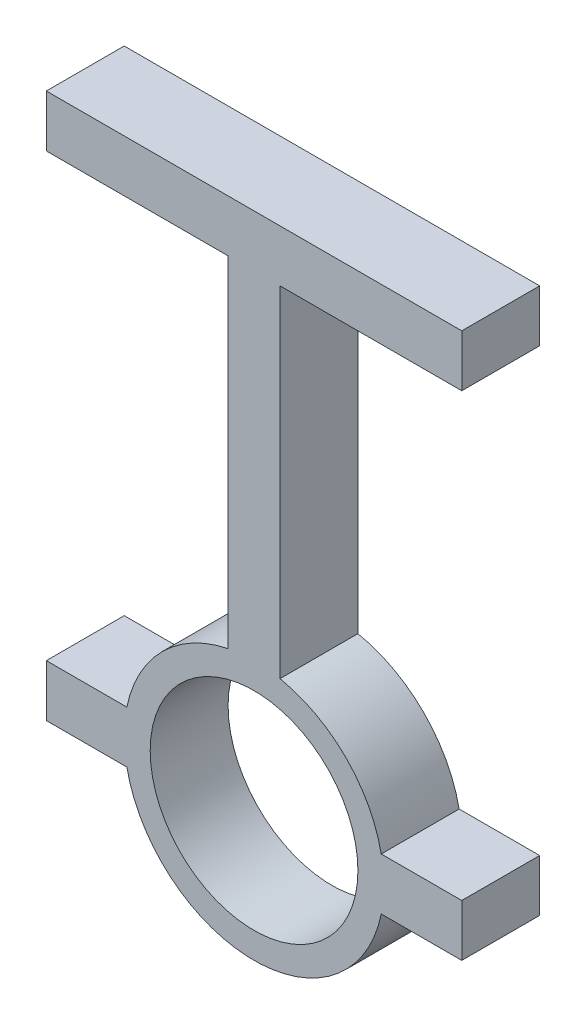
ISO-10303-21;
HEADER;
FILE_DESCRIPTION(('STEP AP214'),'2;1');
FILE_NAME('part.step','',(''),(''),'','','');
FILE_SCHEMA(('AUTOMOTIVE_DESIGN { 1 0 10303 214 1 1 1 1 }'));
ENDSEC;
DATA;
#1=APPLICATION_CONTEXT('core data for automotive mechanical design processes');
#2=APPLICATION_PROTOCOL_DEFINITION('international standard','automotive_design',2000,#1);
#3=PRODUCT_CONTEXT('',#1,'mechanical');
#4=PRODUCT('Part','Part','',(#3));
#5=PRODUCT_RELATED_PRODUCT_CATEGORY('part','',(#4));
#6=PRODUCT_DEFINITION_FORMATION('','',#4);
#7=PRODUCT_DEFINITION_CONTEXT('part definition',#1,'design');
#8=PRODUCT_DEFINITION('design','',#6,#7);
#9=PRODUCT_DEFINITION_SHAPE('','',#8);
#10=(LENGTH_UNIT() NAMED_UNIT(*) SI_UNIT(.MILLI.,.METRE.));
#11=(NAMED_UNIT(*) PLANE_ANGLE_UNIT() SI_UNIT($,.RADIAN.));
#12=(NAMED_UNIT(*) SI_UNIT($,.STERADIAN.) SOLID_ANGLE_UNIT());
#13=UNCERTAINTY_MEASURE_WITH_UNIT(LENGTH_MEASURE(1.E-05),#10,'distance_accuracy_value','');
#14=(GEOMETRIC_REPRESENTATION_CONTEXT(3) GLOBAL_UNCERTAINTY_ASSIGNED_CONTEXT((#13)) GLOBAL_UNIT_ASSIGNED_CONTEXT((#10,
#11,#12)) REPRESENTATION_CONTEXT('',''));
#15=CARTESIAN_POINT('',(0.,0.,0.));
#16=DIRECTION('',(0.,0.,1.));
#17=DIRECTION('',(1.,0.,0.));
#18=AXIS2_PLACEMENT_3D('',#15,#16,#17);
#19=CARTESIAN_POINT('',(0.,0.,15.));
#20=DIRECTION('',(0.,0.,1.));
#21=DIRECTION('',(1.,0.,0.));
#22=AXIS2_PLACEMENT_3D('',#19,#20,#21);
#23=PLANE('',#22);
#24=DIRECTION('',(1.,0.,0.));
#25=VECTOR('',#24,1.);
#26=CARTESIAN_POINT('',(40.,90.,15.));
#27=LINE('',#26,#25);
#28=CARTESIAN_POINT('',(5.,90.,15.));
#29=VERTEX_POINT('',#28);
#30=CARTESIAN_POINT('',(40.,90.,15.));
#31=VERTEX_POINT('',#30);
#32=EDGE_CURVE('E209',#29,#31,#27,.T.);
#33=ORIENTED_EDGE('',*,*,#32,.T.);
#34=DIRECTION('',(0.,1.,0.));
#35=VECTOR('',#34,1.);
#36=CARTESIAN_POINT('',(40.,100.,15.));
#37=LINE('',#36,#35);
#38=CARTESIAN_POINT('',(40.,100.,15.));
#39=VERTEX_POINT('',#38);
#40=EDGE_CURVE('E117',#31,#39,#37,.T.);
#41=ORIENTED_EDGE('',*,*,#40,.T.);
#42=DIRECTION('',(-1.,0.,0.));
#43=VECTOR('',#42,1.);
#44=CARTESIAN_POINT('',(-40.,100.,15.));
#45=LINE('',#44,#43);
#46=CARTESIAN_POINT('',(-40.,100.,15.));
#47=VERTEX_POINT('',#46);
#48=EDGE_CURVE('E248',#39,#47,#45,.T.);
#49=ORIENTED_EDGE('',*,*,#48,.T.);
#50=DIRECTION('',(0.,-1.,0.));
#51=VECTOR('',#50,1.);
#52=CARTESIAN_POINT('',(-40.,90.,15.));
#53=LINE('',#52,#51);
#54=CARTESIAN_POINT('',(-40.,90.,15.));
#55=VERTEX_POINT('',#54);
#56=EDGE_CURVE('E267',#47,#55,#53,.T.);
#57=ORIENTED_EDGE('',*,*,#56,.T.);
#58=DIRECTION('',(1.,0.,0.));
#59=VECTOR('',#58,1.);
#60=CARTESIAN_POINT('',(-5.,90.,15.));
#61=LINE('',#60,#59);
#62=CARTESIAN_POINT('',(-5.,90.,15.));
#63=VERTEX_POINT('',#62);
#64=EDGE_CURVE('E264',#55,#63,#61,.T.);
#65=ORIENTED_EDGE('',*,*,#64,.T.);
#66=DIRECTION('',(0.,-1.,0.));
#67=VECTOR('',#66,1.);
#68=CARTESIAN_POINT('',(-5.,24.4948974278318,15.));
#69=LINE('',#68,#67);
#70=CARTESIAN_POINT('',(-5.,24.4948974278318,15.));
#71=VERTEX_POINT('',#70);
#72=EDGE_CURVE('E266',#63,#71,#69,.T.);
#73=ORIENTED_EDGE('',*,*,#72,.T.);
#74=CARTESIAN_POINT('',(0.,0.,15.));
#75=DIRECTION('',(0.,0.,1.));
#76=DIRECTION('',(1.,0.,0.));
#77=AXIS2_PLACEMENT_3D('',#74,#75,#76);
#78=CIRCLE('',#77,25.);
#79=CARTESIAN_POINT('',(-24.4948974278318,5.,15.));
#80=VERTEX_POINT('',#79);
#81=EDGE_CURVE('E269',#71,#80,#78,.T.);
#82=ORIENTED_EDGE('',*,*,#81,.T.);
#83=DIRECTION('',(-1.,0.,0.));
#84=VECTOR('',#83,1.);
#85=CARTESIAN_POINT('',(-24.4948974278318,5.,15.));
#86=LINE('',#85,#84);
#87=CARTESIAN_POINT('',(-40.,5.,15.));
#88=VERTEX_POINT('',#87);
#89=EDGE_CURVE('E275',#80,#88,#86,.T.);
#90=ORIENTED_EDGE('',*,*,#89,.T.);
#91=DIRECTION('',(0.,-1.,0.));
#92=VECTOR('',#91,1.);
#93=CARTESIAN_POINT('',(-40.,-5.,15.));
#94=LINE('',#93,#92);
#95=CARTESIAN_POINT('',(-40.,-5.,15.));
#96=VERTEX_POINT('',#95);
#97=EDGE_CURVE('E277',#88,#96,#94,.T.);
#98=ORIENTED_EDGE('',*,*,#97,.T.);
#99=DIRECTION('',(1.,0.,0.));
#100=VECTOR('',#99,1.);
#101=CARTESIAN_POINT('',(-24.4948974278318,-5.,15.));
#102=LINE('',#101,#100);
#103=CARTESIAN_POINT('',(-24.4948974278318,-4.99999999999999,15.));
#104=VERTEX_POINT('',#103);
#105=EDGE_CURVE('E279',#96,#104,#102,.T.);
#106=ORIENTED_EDGE('',*,*,#105,.T.);
#107=CARTESIAN_POINT('',(0.,0.,15.));
#108=DIRECTION('',(0.,0.,1.));
#109=DIRECTION('',(1.,0.,0.));
#110=AXIS2_PLACEMENT_3D('',#107,#108,#109);
#111=CIRCLE('',#110,25.);
#112=CARTESIAN_POINT('',(24.4948974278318,-5.,15.));
#113=VERTEX_POINT('',#112);
#114=EDGE_CURVE('E281',#104,#113,#111,.T.);
#115=ORIENTED_EDGE('',*,*,#114,.T.);
#116=DIRECTION('',(1.,0.,0.));
#117=VECTOR('',#116,1.);
#118=CARTESIAN_POINT('',(40.,-5.,15.));
#119=LINE('',#118,#117);
#120=CARTESIAN_POINT('',(40.,-5.,15.));
#121=VERTEX_POINT('',#120);
#122=EDGE_CURVE('E283',#113,#121,#119,.T.);
#123=ORIENTED_EDGE('',*,*,#122,.T.);
#124=DIRECTION('',(0.,1.,0.));
#125=VECTOR('',#124,1.);
#126=CARTESIAN_POINT('',(40.,-5.,15.));
#127=LINE('',#126,#125);
#128=CARTESIAN_POINT('',(40.,5.,15.));
#129=VERTEX_POINT('',#128);
#130=EDGE_CURVE('E160',#121,#129,#127,.T.);
#131=ORIENTED_EDGE('',*,*,#130,.T.);
#132=DIRECTION('',(-1.,0.,0.));
#133=VECTOR('',#132,1.);
#134=CARTESIAN_POINT('',(40.,5.,15.));
#135=LINE('',#134,#133);
#136=CARTESIAN_POINT('',(24.4948974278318,5.,15.));
#137=VERTEX_POINT('',#136);
#138=EDGE_CURVE('E154',#129,#137,#135,.T.);
#139=ORIENTED_EDGE('',*,*,#138,.T.);
#140=CARTESIAN_POINT('',(0.,0.,15.));
#141=DIRECTION('',(0.,0.,1.));
#142=DIRECTION('',(1.,0.,0.));
#143=AXIS2_PLACEMENT_3D('',#140,#141,#142);
#144=CIRCLE('',#143,25.);
#145=CARTESIAN_POINT('',(5.,24.4948974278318,15.));
#146=VERTEX_POINT('',#145);
#147=EDGE_CURVE('E158',#137,#146,#144,.T.);
#148=ORIENTED_EDGE('',*,*,#147,.T.);
#149=DIRECTION('',(0.,1.,0.));
#150=VECTOR('',#149,1.);
#151=CARTESIAN_POINT('',(5.,24.4948974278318,15.));
#152=LINE('',#151,#150);
#153=EDGE_CURVE('E50',#146,#29,#152,.T.);
#154=ORIENTED_EDGE('',*,*,#153,.T.);
#155=EDGE_LOOP('',(#33,#41,#49,#57,#65,#73,#82,#90,#98,#106,#115,#123,#131,#139,#148,#154));
#156=FACE_BOUND('',#155,.T.);
#157=CARTESIAN_POINT('',(0.,0.,15.));
#158=DIRECTION('',(0.,0.,1.));
#159=DIRECTION('',(1.,0.,0.));
#160=AXIS2_PLACEMENT_3D('',#157,#158,#159);
#161=CIRCLE('',#160,20.);
#162=CARTESIAN_POINT('',(20.,0.,15.));
#163=VERTEX_POINT('',#162);
#164=EDGE_CURVE('E182',#163,#163,#161,.T.);
#165=ORIENTED_EDGE('',*,*,#164,.F.);
#166=EDGE_LOOP('',(#165));
#167=FACE_BOUND('',#166,.T.);
#168=ADVANCED_FACE('F33',(#156,#167),#23,.T.);
#169=CARTESIAN_POINT('',(0.,0.,0.));
#170=DIRECTION('',(0.,0.,1.));
#171=DIRECTION('',(1.,0.,0.));
#172=AXIS2_PLACEMENT_3D('',#169,#170,#171);
#173=PLANE('',#172);
#174=DIRECTION('',(1.,0.,0.));
#175=VECTOR('',#174,1.);
#176=CARTESIAN_POINT('',(40.,90.,0.));
#177=LINE('',#176,#175);
#178=CARTESIAN_POINT('',(5.,90.,0.));
#179=VERTEX_POINT('',#178);
#180=CARTESIAN_POINT('',(40.,90.,0.));
#181=VERTEX_POINT('',#180);
#182=EDGE_CURVE('E178',#179,#181,#177,.T.);
#183=ORIENTED_EDGE('',*,*,#182,.F.);
#184=DIRECTION('',(0.,1.,0.));
#185=VECTOR('',#184,1.);
#186=CARTESIAN_POINT('',(5.,24.4948974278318,0.));
#187=LINE('',#186,#185);
#188=CARTESIAN_POINT('',(5.,24.4948974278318,0.));
#189=VERTEX_POINT('',#188);
#190=EDGE_CURVE('E109',#189,#179,#187,.T.);
#191=ORIENTED_EDGE('',*,*,#190,.F.);
#192=CARTESIAN_POINT('',(0.,0.,0.));
#193=DIRECTION('',(0.,0.,1.));
#194=DIRECTION('',(1.,0.,0.));
#195=AXIS2_PLACEMENT_3D('',#192,#193,#194);
#196=CIRCLE('',#195,25.);
#197=CARTESIAN_POINT('',(24.4948974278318,5.,0.));
#198=VERTEX_POINT('',#197);
#199=EDGE_CURVE('E103',#198,#189,#196,.T.);
#200=ORIENTED_EDGE('',*,*,#199,.F.);
#201=DIRECTION('',(-1.,0.,0.));
#202=VECTOR('',#201,1.);
#203=CARTESIAN_POINT('',(40.,5.,0.));
#204=LINE('',#203,#202);
#205=CARTESIAN_POINT('',(40.,5.,0.));
#206=VERTEX_POINT('',#205);
#207=EDGE_CURVE('E168',#206,#198,#204,.T.);
#208=ORIENTED_EDGE('',*,*,#207,.F.);
#209=DIRECTION('',(0.,1.,0.));
#210=VECTOR('',#209,1.);
#211=CARTESIAN_POINT('',(40.,-5.,0.));
#212=LINE('',#211,#210);
#213=CARTESIAN_POINT('',(40.,-5.,0.));
#214=VERTEX_POINT('',#213);
#215=EDGE_CURVE('E204',#214,#206,#212,.T.);
#216=ORIENTED_EDGE('',*,*,#215,.F.);
#217=DIRECTION('',(1.,0.,0.));
#218=VECTOR('',#217,1.);
#219=CARTESIAN_POINT('',(40.,-5.,0.));
#220=LINE('',#219,#218);
#221=CARTESIAN_POINT('',(24.4948974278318,-5.,0.));
#222=VERTEX_POINT('',#221);
#223=EDGE_CURVE('E202',#222,#214,#220,.T.);
#224=ORIENTED_EDGE('',*,*,#223,.F.);
#225=CARTESIAN_POINT('',(0.,0.,0.));
#226=DIRECTION('',(0.,0.,1.));
#227=DIRECTION('',(1.,0.,0.));
#228=AXIS2_PLACEMENT_3D('',#225,#226,#227);
#229=CIRCLE('',#228,25.);
#230=CARTESIAN_POINT('',(-24.4948974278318,-4.99999999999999,0.));
#231=VERTEX_POINT('',#230);
#232=EDGE_CURVE('E200',#231,#222,#229,.T.);
#233=ORIENTED_EDGE('',*,*,#232,.F.);
#234=DIRECTION('',(1.,0.,0.));
#235=VECTOR('',#234,1.);
#236=CARTESIAN_POINT('',(-24.4948974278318,-5.,0.));
#237=LINE('',#236,#235);
#238=CARTESIAN_POINT('',(-40.,-5.,0.));
#239=VERTEX_POINT('',#238);
#240=EDGE_CURVE('E198',#239,#231,#237,.T.);
#241=ORIENTED_EDGE('',*,*,#240,.F.);
#242=DIRECTION('',(0.,-1.,0.));
#243=VECTOR('',#242,1.);
#244=CARTESIAN_POINT('',(-40.,-5.,0.));
#245=LINE('',#244,#243);
#246=CARTESIAN_POINT('',(-40.,5.,0.));
#247=VERTEX_POINT('',#246);
#248=EDGE_CURVE('E196',#247,#239,#245,.T.);
#249=ORIENTED_EDGE('',*,*,#248,.F.);
#250=DIRECTION('',(-1.,0.,0.));
#251=VECTOR('',#250,1.);
#252=CARTESIAN_POINT('',(-24.4948974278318,5.,0.));
#253=LINE('',#252,#251);
#254=CARTESIAN_POINT('',(-24.4948974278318,5.,0.));
#255=VERTEX_POINT('',#254);
#256=EDGE_CURVE('E194',#255,#247,#253,.T.);
#257=ORIENTED_EDGE('',*,*,#256,.F.);
#258=CARTESIAN_POINT('',(0.,0.,0.));
#259=DIRECTION('',(0.,0.,1.));
#260=DIRECTION('',(1.,0.,0.));
#261=AXIS2_PLACEMENT_3D('',#258,#259,#260);
#262=CIRCLE('',#261,25.);
#263=CARTESIAN_POINT('',(-5.,24.4948974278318,0.));
#264=VERTEX_POINT('',#263);
#265=EDGE_CURVE('E192',#264,#255,#262,.T.);
#266=ORIENTED_EDGE('',*,*,#265,.F.);
#267=DIRECTION('',(0.,-1.,0.));
#268=VECTOR('',#267,1.);
#269=CARTESIAN_POINT('',(-5.,24.4948974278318,0.));
#270=LINE('',#269,#268);
#271=CARTESIAN_POINT('',(-5.,90.,0.));
#272=VERTEX_POINT('',#271);
#273=EDGE_CURVE('E190',#272,#264,#270,.T.);
#274=ORIENTED_EDGE('',*,*,#273,.F.);
#275=DIRECTION('',(1.,0.,0.));
#276=VECTOR('',#275,1.);
#277=CARTESIAN_POINT('',(-5.,90.,0.));
#278=LINE('',#277,#276);
#279=CARTESIAN_POINT('',(-40.,90.,0.));
#280=VERTEX_POINT('',#279);
#281=EDGE_CURVE('E188',#280,#272,#278,.T.);
#282=ORIENTED_EDGE('',*,*,#281,.F.);
#283=DIRECTION('',(0.,-1.,0.));
#284=VECTOR('',#283,1.);
#285=CARTESIAN_POINT('',(-40.,90.,0.));
#286=LINE('',#285,#284);
#287=CARTESIAN_POINT('',(-40.,100.,0.));
#288=VERTEX_POINT('',#287);
#289=EDGE_CURVE('E186',#288,#280,#286,.T.);
#290=ORIENTED_EDGE('',*,*,#289,.F.);
#291=DIRECTION('',(-1.,0.,0.));
#292=VECTOR('',#291,1.);
#293=CARTESIAN_POINT('',(-40.,100.,0.));
#294=LINE('',#293,#292);
#295=CARTESIAN_POINT('',(40.,100.,0.));
#296=VERTEX_POINT('',#295);
#297=EDGE_CURVE('E184',#296,#288,#294,.T.);
#298=ORIENTED_EDGE('',*,*,#297,.F.);
#299=DIRECTION('',(0.,1.,0.));
#300=VECTOR('',#299,1.);
#301=CARTESIAN_POINT('',(40.,100.,0.));
#302=LINE('',#301,#300);
#303=EDGE_CURVE('E181',#181,#296,#302,.T.);
#304=ORIENTED_EDGE('',*,*,#303,.F.);
#305=EDGE_LOOP('',(#183,#191,#200,#208,#216,#224,#233,#241,#249,#257,#266,#274,#282,#290,#298,#304));
#306=FACE_BOUND('',#305,.T.);
#307=CARTESIAN_POINT('',(0.,0.,0.));
#308=DIRECTION('',(0.,0.,1.));
#309=DIRECTION('',(1.,0.,0.));
#310=AXIS2_PLACEMENT_3D('',#307,#308,#309);
#311=CIRCLE('',#310,20.);
#312=CARTESIAN_POINT('',(20.,0.,0.));
#313=VERTEX_POINT('',#312);
#314=EDGE_CURVE('E482',#313,#313,#311,.T.);
#315=ORIENTED_EDGE('',*,*,#314,.T.);
#316=EDGE_LOOP('',(#315));
#317=FACE_BOUND('',#316,.T.);
#318=ADVANCED_FACE('F252',(#306,#317),#173,.F.);
#319=CARTESIAN_POINT('',(40.,90.,15.));
#320=DIRECTION('',(0.,1.,0.));
#321=DIRECTION('',(-1.,0.,0.));
#322=AXIS2_PLACEMENT_3D('',#319,#320,#321);
#323=PLANE('',#322);
#324=ORIENTED_EDGE('',*,*,#182,.T.);
#325=DIRECTION('',(0.,0.,-1.));
#326=VECTOR('',#325,1.);
#327=CARTESIAN_POINT('',(40.,90.,15.));
#328=LINE('',#327,#326);
#329=EDGE_CURVE('E11',#31,#181,#328,.T.);
#330=ORIENTED_EDGE('',*,*,#329,.F.);
#331=ORIENTED_EDGE('',*,*,#32,.F.);
#332=DIRECTION('',(0.,0.,-1.));
#333=VECTOR('',#332,1.);
#334=CARTESIAN_POINT('',(5.,90.,15.));
#335=LINE('',#334,#333);
#336=EDGE_CURVE('E174',#29,#179,#335,.T.);
#337=ORIENTED_EDGE('',*,*,#336,.T.);
#338=EDGE_LOOP('',(#324,#330,#331,#337));
#339=FACE_BOUND('',#338,.T.);
#340=ADVANCED_FACE('F35',(#339),#323,.F.);
#341=CARTESIAN_POINT('',(40.,100.,15.));
#342=DIRECTION('',(-1.,0.,0.));
#343=DIRECTION('',(0.,0.,1.));
#344=AXIS2_PLACEMENT_3D('',#341,#342,#343);
#345=PLANE('',#344);
#346=ORIENTED_EDGE('',*,*,#303,.T.);
#347=DIRECTION('',(0.,0.,-1.));
#348=VECTOR('',#347,1.);
#349=CARTESIAN_POINT('',(40.,100.,15.));
#350=LINE('',#349,#348);
#351=EDGE_CURVE('E42',#39,#296,#350,.T.);
#352=ORIENTED_EDGE('',*,*,#351,.F.);
#353=ORIENTED_EDGE('',*,*,#40,.F.);
#354=ORIENTED_EDGE('',*,*,#329,.T.);
#355=EDGE_LOOP('',(#346,#352,#353,#354));
#356=FACE_BOUND('',#355,.T.);
#357=ADVANCED_FACE('F317',(#356),#345,.F.);
#358=CARTESIAN_POINT('',(-40.,100.,15.));
#359=DIRECTION('',(0.,-1.,0.));
#360=DIRECTION('',(0.,0.,-1.));
#361=AXIS2_PLACEMENT_3D('',#358,#359,#360);
#362=PLANE('',#361);
#363=ORIENTED_EDGE('',*,*,#297,.T.);
#364=DIRECTION('',(0.,0.,-1.));
#365=VECTOR('',#364,1.);
#366=CARTESIAN_POINT('',(-40.,100.,15.));
#367=LINE('',#366,#365);
#368=EDGE_CURVE('E240',#47,#288,#367,.T.);
#369=ORIENTED_EDGE('',*,*,#368,.F.);
#370=ORIENTED_EDGE('',*,*,#48,.F.);
#371=ORIENTED_EDGE('',*,*,#351,.T.);
#372=EDGE_LOOP('',(#363,#369,#370,#371));
#373=FACE_BOUND('',#372,.T.);
#374=ADVANCED_FACE('F246',(#373),#362,.F.);
#375=CARTESIAN_POINT('',(-40.,90.,15.));
#376=DIRECTION('',(1.,0.,0.));
#377=DIRECTION('',(0.,0.,-1.));
#378=AXIS2_PLACEMENT_3D('',#375,#376,#377);
#379=PLANE('',#378);
#380=ORIENTED_EDGE('',*,*,#289,.T.);
#381=DIRECTION('',(0.,0.,-1.));
#382=VECTOR('',#381,1.);
#383=CARTESIAN_POINT('',(-40.,90.,15.));
#384=LINE('',#383,#382);
#385=EDGE_CURVE('E237',#55,#280,#384,.T.);
#386=ORIENTED_EDGE('',*,*,#385,.F.);
#387=ORIENTED_EDGE('',*,*,#56,.F.);
#388=ORIENTED_EDGE('',*,*,#368,.T.);
#389=EDGE_LOOP('',(#380,#386,#387,#388));
#390=FACE_BOUND('',#389,.T.);
#391=ADVANCED_FACE('F258',(#390),#379,.F.);
#392=CARTESIAN_POINT('',(-5.,90.,15.));
#393=DIRECTION('',(0.,1.,0.));
#394=DIRECTION('',(-1.,0.,0.));
#395=AXIS2_PLACEMENT_3D('',#392,#393,#394);
#396=PLANE('',#395);
#397=ORIENTED_EDGE('',*,*,#281,.T.);
#398=DIRECTION('',(0.,0.,-1.));
#399=VECTOR('',#398,1.);
#400=CARTESIAN_POINT('',(-5.,90.,15.));
#401=LINE('',#400,#399);
#402=EDGE_CURVE('E234',#63,#272,#401,.T.);
#403=ORIENTED_EDGE('',*,*,#402,.F.);
#404=ORIENTED_EDGE('',*,*,#64,.F.);
#405=ORIENTED_EDGE('',*,*,#385,.T.);
#406=EDGE_LOOP('',(#397,#403,#404,#405));
#407=FACE_BOUND('',#406,.T.);
#408=ADVANCED_FACE('F262',(#407),#396,.F.);
#409=CARTESIAN_POINT('',(-5.,24.4948974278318,15.));
#410=DIRECTION('',(1.,0.,0.));
#411=DIRECTION('',(0.,0.,-1.));
#412=AXIS2_PLACEMENT_3D('',#409,#410,#411);
#413=PLANE('',#412);
#414=ORIENTED_EDGE('',*,*,#273,.T.);
#415=DIRECTION('',(0.,0.,-1.));
#416=VECTOR('',#415,1.);
#417=CARTESIAN_POINT('',(-5.,24.4948974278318,15.));
#418=LINE('',#417,#416);
#419=EDGE_CURVE('E231',#71,#264,#418,.T.);
#420=ORIENTED_EDGE('',*,*,#419,.F.);
#421=ORIENTED_EDGE('',*,*,#72,.F.);
#422=ORIENTED_EDGE('',*,*,#402,.T.);
#423=EDGE_LOOP('',(#414,#420,#421,#422));
#424=FACE_BOUND('',#423,.T.);
#425=ADVANCED_FACE('F330',(#424),#413,.F.);
#426=CARTESIAN_POINT('',(0.,0.,15.));
#427=DIRECTION('',(0.,0.,-1.));
#428=DIRECTION('',(-1.,0.,0.));
#429=AXIS2_PLACEMENT_3D('',#426,#427,#428);
#430=CYLINDRICAL_SURFACE('',#429,25.);
#431=ORIENTED_EDGE('',*,*,#265,.T.);
#432=DIRECTION('',(0.,0.,-1.));
#433=VECTOR('',#432,1.);
#434=CARTESIAN_POINT('',(-24.4948974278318,5.,15.));
#435=LINE('',#434,#433);
#436=EDGE_CURVE('E228',#80,#255,#435,.T.);
#437=ORIENTED_EDGE('',*,*,#436,.F.);
#438=ORIENTED_EDGE('',*,*,#81,.F.);
#439=ORIENTED_EDGE('',*,*,#419,.T.);
#440=EDGE_LOOP('',(#431,#437,#438,#439));
#441=FACE_BOUND('',#440,.T.);
#442=ADVANCED_FACE('F333',(#441),#430,.T.);
#443=CARTESIAN_POINT('',(-24.4948974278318,5.,15.));
#444=DIRECTION('',(0.,-1.,0.));
#445=DIRECTION('',(1.,0.,0.));
#446=AXIS2_PLACEMENT_3D('',#443,#444,#445);
#447=PLANE('',#446);
#448=ORIENTED_EDGE('',*,*,#256,.T.);
#449=DIRECTION('',(0.,0.,-1.));
#450=VECTOR('',#449,1.);
#451=CARTESIAN_POINT('',(-40.,5.,15.));
#452=LINE('',#451,#450);
#453=EDGE_CURVE('E225',#88,#247,#452,.T.);
#454=ORIENTED_EDGE('',*,*,#453,.F.);
#455=ORIENTED_EDGE('',*,*,#89,.F.);
#456=ORIENTED_EDGE('',*,*,#436,.T.);
#457=EDGE_LOOP('',(#448,#454,#455,#456));
#458=FACE_BOUND('',#457,.T.);
#459=ADVANCED_FACE('F337',(#458),#447,.F.);
#460=CARTESIAN_POINT('',(-40.,-5.,15.));
#461=DIRECTION('',(1.,0.,0.));
#462=DIRECTION('',(0.,0.,-1.));
#463=AXIS2_PLACEMENT_3D('',#460,#461,#462);
#464=PLANE('',#463);
#465=ORIENTED_EDGE('',*,*,#248,.T.);
#466=DIRECTION('',(0.,0.,-1.));
#467=VECTOR('',#466,1.);
#468=CARTESIAN_POINT('',(-40.,-5.,15.));
#469=LINE('',#468,#467);
#470=EDGE_CURVE('E222',#96,#239,#469,.T.);
#471=ORIENTED_EDGE('',*,*,#470,.F.);
#472=ORIENTED_EDGE('',*,*,#97,.F.);
#473=ORIENTED_EDGE('',*,*,#453,.T.);
#474=EDGE_LOOP('',(#465,#471,#472,#473));
#475=FACE_BOUND('',#474,.T.);
#476=ADVANCED_FACE('F341',(#475),#464,.F.);
#477=CARTESIAN_POINT('',(-24.4948974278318,-5.,15.));
#478=DIRECTION('',(0.,1.,0.));
#479=DIRECTION('',(-1.,0.,0.));
#480=AXIS2_PLACEMENT_3D('',#477,#478,#479);
#481=PLANE('',#480);
#482=ORIENTED_EDGE('',*,*,#240,.T.);
#483=DIRECTION('',(0.,0.,-1.));
#484=VECTOR('',#483,1.);
#485=CARTESIAN_POINT('',(-24.4948974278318,-4.99999999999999,15.));
#486=LINE('',#485,#484);
#487=EDGE_CURVE('E219',#104,#231,#486,.T.);
#488=ORIENTED_EDGE('',*,*,#487,.F.);
#489=ORIENTED_EDGE('',*,*,#105,.F.);
#490=ORIENTED_EDGE('',*,*,#470,.T.);
#491=EDGE_LOOP('',(#482,#488,#489,#490));
#492=FACE_BOUND('',#491,.T.);
#493=ADVANCED_FACE('F345',(#492),#481,.F.);
#494=CARTESIAN_POINT('',(0.,0.,15.));
#495=DIRECTION('',(0.,0.,-1.));
#496=DIRECTION('',(-1.,0.,0.));
#497=AXIS2_PLACEMENT_3D('',#494,#495,#496);
#498=CYLINDRICAL_SURFACE('',#497,25.);
#499=ORIENTED_EDGE('',*,*,#232,.T.);
#500=DIRECTION('',(0.,0.,-1.));
#501=VECTOR('',#500,1.);
#502=CARTESIAN_POINT('',(24.4948974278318,-5.,15.));
#503=LINE('',#502,#501);
#504=EDGE_CURVE('E216',#113,#222,#503,.T.);
#505=ORIENTED_EDGE('',*,*,#504,.F.);
#506=ORIENTED_EDGE('',*,*,#114,.F.);
#507=ORIENTED_EDGE('',*,*,#487,.T.);
#508=EDGE_LOOP('',(#499,#505,#506,#507));
#509=FACE_BOUND('',#508,.T.);
#510=ADVANCED_FACE('F349',(#509),#498,.T.);
#511=CARTESIAN_POINT('',(40.,-5.,15.));
#512=DIRECTION('',(0.,1.,0.));
#513=DIRECTION('',(0.,0.,1.));
#514=AXIS2_PLACEMENT_3D('',#511,#512,#513);
#515=PLANE('',#514);
#516=ORIENTED_EDGE('',*,*,#223,.T.);
#517=DIRECTION('',(0.,0.,-1.));
#518=VECTOR('',#517,1.);
#519=CARTESIAN_POINT('',(40.,-5.,15.));
#520=LINE('',#519,#518);
#521=EDGE_CURVE('E213',#121,#214,#520,.T.);
#522=ORIENTED_EDGE('',*,*,#521,.F.);
#523=ORIENTED_EDGE('',*,*,#122,.F.);
#524=ORIENTED_EDGE('',*,*,#504,.T.);
#525=EDGE_LOOP('',(#516,#522,#523,#524));
#526=FACE_BOUND('',#525,.T.);
#527=ADVANCED_FACE('F289',(#526),#515,.F.);
#528=CARTESIAN_POINT('',(40.,-5.,15.));
#529=DIRECTION('',(-1.,0.,0.));
#530=DIRECTION('',(0.,0.,1.));
#531=AXIS2_PLACEMENT_3D('',#528,#529,#530);
#532=PLANE('',#531);
#533=ORIENTED_EDGE('',*,*,#215,.T.);
#534=DIRECTION('',(0.,0.,-1.));
#535=VECTOR('',#534,1.);
#536=CARTESIAN_POINT('',(40.,5.,15.));
#537=LINE('',#536,#535);
#538=EDGE_CURVE('E169',#129,#206,#537,.T.);
#539=ORIENTED_EDGE('',*,*,#538,.F.);
#540=ORIENTED_EDGE('',*,*,#130,.F.);
#541=ORIENTED_EDGE('',*,*,#521,.T.);
#542=EDGE_LOOP('',(#533,#539,#540,#541));
#543=FACE_BOUND('',#542,.T.);
#544=ADVANCED_FACE('F293',(#543),#532,.F.);
#545=CARTESIAN_POINT('',(40.,5.,15.));
#546=DIRECTION('',(0.,-1.,0.));
#547=DIRECTION('',(0.,0.,-1.));
#548=AXIS2_PLACEMENT_3D('',#545,#546,#547);
#549=PLANE('',#548);
#550=ORIENTED_EDGE('',*,*,#207,.T.);
#551=DIRECTION('',(0.,0.,-1.));
#552=VECTOR('',#551,1.);
#553=CARTESIAN_POINT('',(24.4948974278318,5.,15.));
#554=LINE('',#553,#552);
#555=EDGE_CURVE('E165',#137,#198,#554,.T.);
#556=ORIENTED_EDGE('',*,*,#555,.F.);
#557=ORIENTED_EDGE('',*,*,#138,.F.);
#558=ORIENTED_EDGE('',*,*,#538,.T.);
#559=EDGE_LOOP('',(#550,#556,#557,#558));
#560=FACE_BOUND('',#559,.T.);
#561=ADVANCED_FACE('F166',(#560),#549,.F.);
#562=CARTESIAN_POINT('',(0.,0.,15.));
#563=DIRECTION('',(0.,0.,-1.));
#564=DIRECTION('',(-1.,0.,0.));
#565=AXIS2_PLACEMENT_3D('',#562,#563,#564);
#566=CYLINDRICAL_SURFACE('',#565,25.);
#567=ORIENTED_EDGE('',*,*,#199,.T.);
#568=DIRECTION('',(0.,0.,-1.));
#569=VECTOR('',#568,1.);
#570=CARTESIAN_POINT('',(5.,24.4948974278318,15.));
#571=LINE('',#570,#569);
#572=EDGE_CURVE('E170',#146,#189,#571,.T.);
#573=ORIENTED_EDGE('',*,*,#572,.F.);
#574=ORIENTED_EDGE('',*,*,#147,.F.);
#575=ORIENTED_EDGE('',*,*,#555,.T.);
#576=EDGE_LOOP('',(#567,#573,#574,#575));
#577=FACE_BOUND('',#576,.T.);
#578=ADVANCED_FACE('F172',(#577),#566,.T.);
#579=CARTESIAN_POINT('',(5.,24.4948974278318,15.));
#580=DIRECTION('',(-1.,0.,0.));
#581=DIRECTION('',(0.,0.,1.));
#582=AXIS2_PLACEMENT_3D('',#579,#580,#581);
#583=PLANE('',#582);
#584=ORIENTED_EDGE('',*,*,#190,.T.);
#585=ORIENTED_EDGE('',*,*,#336,.F.);
#586=ORIENTED_EDGE('',*,*,#153,.F.);
#587=ORIENTED_EDGE('',*,*,#572,.T.);
#588=EDGE_LOOP('',(#584,#585,#586,#587));
#589=FACE_BOUND('',#588,.T.);
#590=ADVANCED_FACE('F297',(#589),#583,.F.);
#591=CARTESIAN_POINT('',(0.,0.,15.));
#592=DIRECTION('',(0.,0.,-1.));
#593=DIRECTION('',(-1.,0.,0.));
#594=AXIS2_PLACEMENT_3D('',#591,#592,#593);
#595=CYLINDRICAL_SURFACE('',#594,20.);
#596=ORIENTED_EDGE('',*,*,#164,.T.);
#597=EDGE_LOOP('',(#596));
#598=FACE_BOUND('',#597,.T.);
#599=ORIENTED_EDGE('',*,*,#314,.F.);
#600=EDGE_LOOP('',(#599));
#601=FACE_BOUND('',#600,.T.);
#602=ADVANCED_FACE('F299',(#598,#601),#595,.F.);
#603=CLOSED_SHELL('',(#168,#318,#340,#357,#374,#391,#408,#425,#442,#459,#476,#493,#510,#527,
#544,#561,#578,#590,#602));
#604=MANIFOLD_SOLID_BREP('B2',#603);
#605=ADVANCED_BREP_SHAPE_REPRESENTATION('',(#18,#604),#14);
#606=SHAPE_DEFINITION_REPRESENTATION(#9,#605);
ENDSEC;
END-ISO-10303-21;
